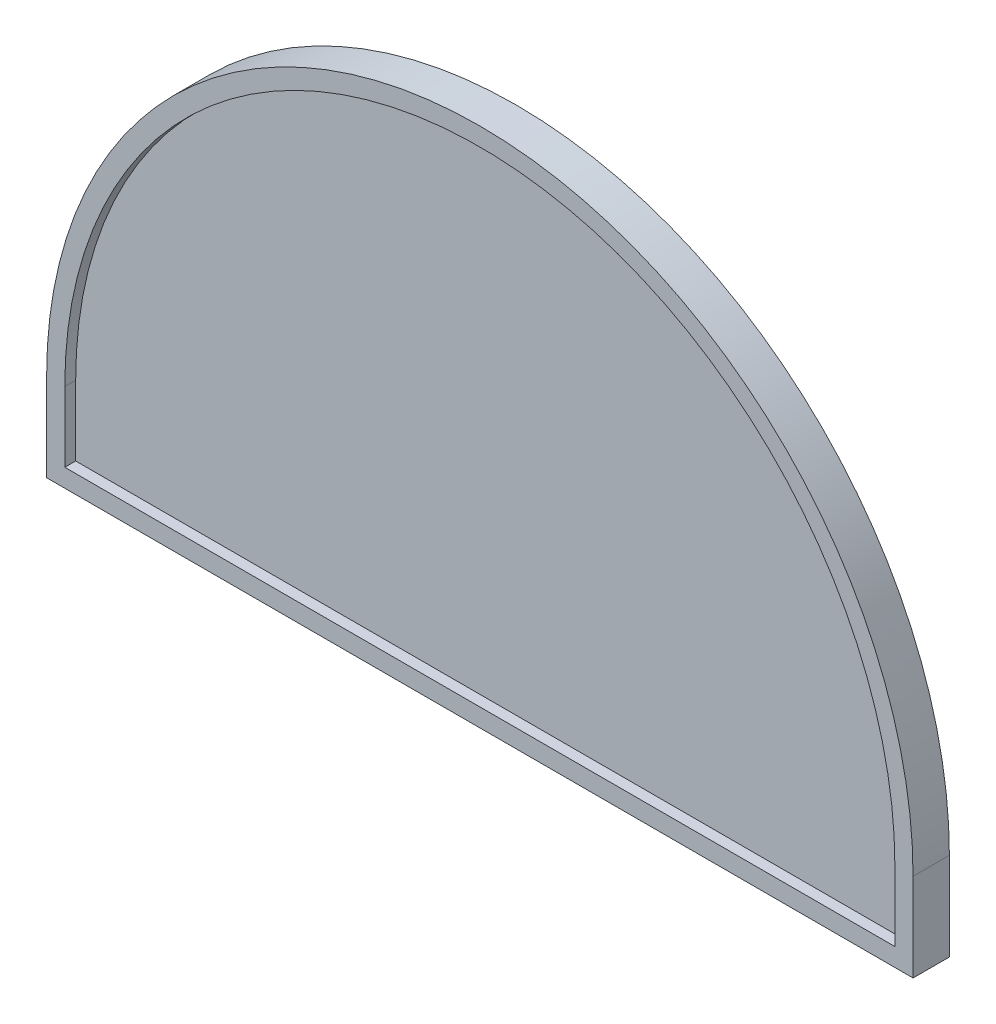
from build123d import *

# Parameters (mm, degrees)
INLAYBACKING_DEPTH = 2.8
OUTERRIM_DEPTH     = 4


with BuildPart() as part:
    # Sketch1 → InlayBacking (new body)
    with BuildSketch(Plane.XY):
        with BuildLine():
            Line((45.7, 0), (45.7, -7.7))
            Line((45.7, -7.7), (-45.7, -7.7))
            Line((-45.7, -7.7), (-45.7, 0))
            ThreePointArc((-45.7, 0), (0, 45.7), (45.7, 0))
        make_face()
    extrude(amount=INLAYBACKING_DEPTH)

    # Sketch1_4 → OuterRim (add)
    with BuildSketch(Plane.XY):
        with BuildLine():
            Line((-47.7, 0), (-47.7, -9.7))
            Line((-47.7, -9.7), (47.7, -9.7))
            Line((47.7, -9.7), (47.7, 0))
            ThreePointArc((47.7, 0), (0, 47.7), (-47.7, 0))
        make_face()
        with BuildLine():
            Line((45.7, 0), (45.7, -7.7))
            Line((45.7, -7.7), (-45.7, -7.7))
            Line((-45.7, -7.7), (-45.7, 0))
            ThreePointArc((-45.7, 0), (0, 45.7), (45.7, 0))
        make_face(mode=Mode.SUBTRACT)
    extrude(amount=OUTERRIM_DEPTH)


solid = part.part
